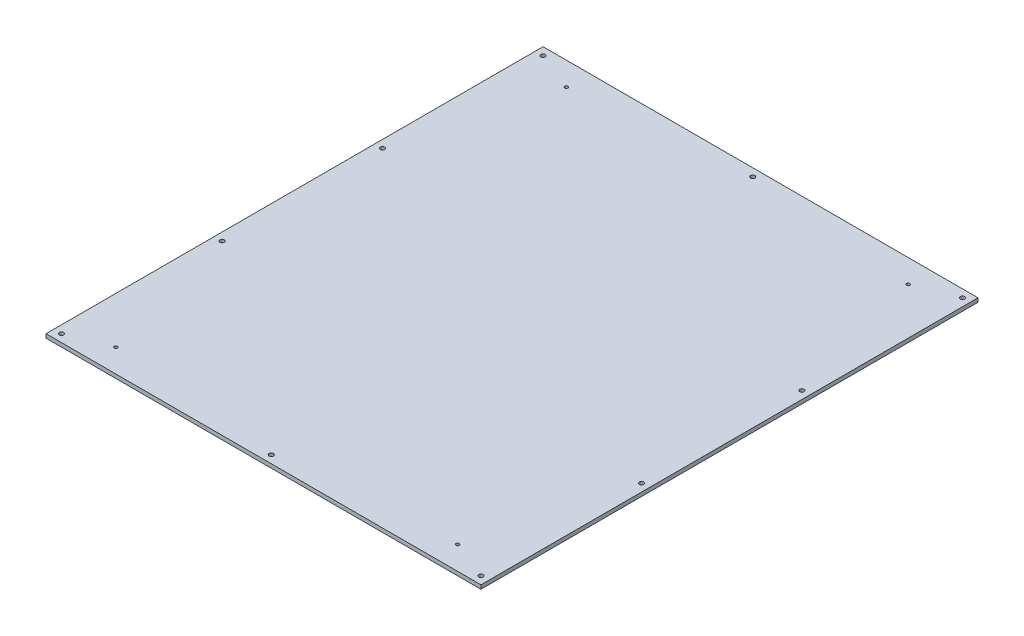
ISO-10303-21;
HEADER;
FILE_DESCRIPTION(('STEP AP214'),'2;1');
FILE_NAME('part.step','',(''),(''),'','','');
FILE_SCHEMA(('AUTOMOTIVE_DESIGN { 1 0 10303 214 1 1 1 1 }'));
ENDSEC;
DATA;
#1=APPLICATION_CONTEXT('core data for automotive mechanical design processes');
#2=APPLICATION_PROTOCOL_DEFINITION('international standard','automotive_design',2000,#1);
#3=PRODUCT_CONTEXT('',#1,'mechanical');
#4=PRODUCT('Part','Part','',(#3));
#5=PRODUCT_RELATED_PRODUCT_CATEGORY('part','',(#4));
#6=PRODUCT_DEFINITION_FORMATION('','',#4);
#7=PRODUCT_DEFINITION_CONTEXT('part definition',#1,'design');
#8=PRODUCT_DEFINITION('design','',#6,#7);
#9=PRODUCT_DEFINITION_SHAPE('','',#8);
#10=(LENGTH_UNIT() NAMED_UNIT(*) SI_UNIT(.MILLI.,.METRE.));
#11=(NAMED_UNIT(*) PLANE_ANGLE_UNIT() SI_UNIT($,.RADIAN.));
#12=(NAMED_UNIT(*) SI_UNIT($,.STERADIAN.) SOLID_ANGLE_UNIT());
#13=UNCERTAINTY_MEASURE_WITH_UNIT(LENGTH_MEASURE(1.E-05),#10,'distance_accuracy_value','');
#14=(GEOMETRIC_REPRESENTATION_CONTEXT(3) GLOBAL_UNCERTAINTY_ASSIGNED_CONTEXT((#13)) GLOBAL_UNIT_ASSIGNED_CONTEXT((#10,
#11,#12)) REPRESENTATION_CONTEXT('',''));
#15=CARTESIAN_POINT('',(0.,0.,0.));
#16=DIRECTION('',(0.,0.,1.));
#17=DIRECTION('',(1.,0.,0.));
#18=AXIS2_PLACEMENT_3D('',#15,#16,#17);
#19=CARTESIAN_POINT('',(355.6,6.35,-406.4));
#20=DIRECTION('',(-1.,0.,0.));
#21=DIRECTION('',(0.,0.,1.));
#22=AXIS2_PLACEMENT_3D('',#19,#20,#21);
#23=PLANE('',#22);
#24=DIRECTION('',(0.,0.,-1.));
#25=VECTOR('',#24,1.);
#26=CARTESIAN_POINT('',(355.6,0.,-406.4));
#27=LINE('',#26,#25);
#28=CARTESIAN_POINT('',(355.6,0.,406.4));
#29=VERTEX_POINT('',#28);
#30=CARTESIAN_POINT('',(355.6,0.,-406.4));
#31=VERTEX_POINT('',#30);
#32=EDGE_CURVE('E101',#29,#31,#27,.T.);
#33=ORIENTED_EDGE('',*,*,#32,.T.);
#34=DIRECTION('',(0.,-1.,0.));
#35=VECTOR('',#34,1.);
#36=CARTESIAN_POINT('',(355.6,6.35,-406.4));
#37=LINE('',#36,#35);
#38=CARTESIAN_POINT('',(355.6,6.35,-406.4));
#39=VERTEX_POINT('',#38);
#40=EDGE_CURVE('E11',#39,#31,#37,.T.);
#41=ORIENTED_EDGE('',*,*,#40,.F.);
#42=DIRECTION('',(0.,0.,-1.));
#43=VECTOR('',#42,1.);
#44=CARTESIAN_POINT('',(355.6,6.35,-406.4));
#45=LINE('',#44,#43);
#46=CARTESIAN_POINT('',(355.6,6.35,406.4));
#47=VERTEX_POINT('',#46);
#48=EDGE_CURVE('E88',#47,#39,#45,.T.);
#49=ORIENTED_EDGE('',*,*,#48,.F.);
#50=DIRECTION('',(0.,-1.,0.));
#51=VECTOR('',#50,1.);
#52=CARTESIAN_POINT('',(355.6,6.35,406.4));
#53=LINE('',#52,#51);
#54=EDGE_CURVE('E97',#47,#29,#53,.T.);
#55=ORIENTED_EDGE('',*,*,#54,.T.);
#56=EDGE_LOOP('',(#33,#41,#49,#55));
#57=FACE_BOUND('',#56,.T.);
#58=ADVANCED_FACE('F35',(#57),#23,.F.);
#59=CARTESIAN_POINT('',(-355.6,6.35,-406.4));
#60=DIRECTION('',(0.,0.,1.));
#61=DIRECTION('',(1.,0.,0.));
#62=AXIS2_PLACEMENT_3D('',#59,#60,#61);
#63=PLANE('',#62);
#64=DIRECTION('',(-1.,0.,0.));
#65=VECTOR('',#64,1.);
#66=CARTESIAN_POINT('',(-355.6,0.,-406.4));
#67=LINE('',#66,#65);
#68=CARTESIAN_POINT('',(-355.6,0.,-406.4));
#69=VERTEX_POINT('',#68);
#70=EDGE_CURVE('E92',#31,#69,#67,.T.);
#71=ORIENTED_EDGE('',*,*,#70,.T.);
#72=DIRECTION('',(0.,-1.,0.));
#73=VECTOR('',#72,1.);
#74=CARTESIAN_POINT('',(-355.6,6.35,-406.4));
#75=LINE('',#74,#73);
#76=CARTESIAN_POINT('',(-355.6,6.35,-406.4));
#77=VERTEX_POINT('',#76);
#78=EDGE_CURVE('E44',#77,#69,#75,.T.);
#79=ORIENTED_EDGE('',*,*,#78,.F.);
#80=DIRECTION('',(-1.,0.,0.));
#81=VECTOR('',#80,1.);
#82=CARTESIAN_POINT('',(-355.6,6.35,-406.4));
#83=LINE('',#82,#81);
#84=EDGE_CURVE('E83',#39,#77,#83,.T.);
#85=ORIENTED_EDGE('',*,*,#84,.F.);
#86=ORIENTED_EDGE('',*,*,#40,.T.);
#87=EDGE_LOOP('',(#71,#79,#85,#86));
#88=FACE_BOUND('',#87,.T.);
#89=ADVANCED_FACE('F91',(#88),#63,.F.);
#90=CARTESIAN_POINT('',(-355.6,6.35,-406.4));
#91=DIRECTION('',(1.,0.,0.));
#92=DIRECTION('',(0.,0.,-1.));
#93=AXIS2_PLACEMENT_3D('',#90,#91,#92);
#94=PLANE('',#93);
#95=DIRECTION('',(0.,0.,1.));
#96=VECTOR('',#95,1.);
#97=CARTESIAN_POINT('',(-355.6,0.,-406.4));
#98=LINE('',#97,#96);
#99=CARTESIAN_POINT('',(-355.6,0.,406.4));
#100=VERTEX_POINT('',#99);
#101=EDGE_CURVE('E70',#69,#100,#98,.T.);
#102=ORIENTED_EDGE('',*,*,#101,.T.);
#103=DIRECTION('',(0.,-1.,0.));
#104=VECTOR('',#103,1.);
#105=CARTESIAN_POINT('',(-355.6,6.35,406.4));
#106=LINE('',#105,#104);
#107=CARTESIAN_POINT('',(-355.6,6.35,406.4));
#108=VERTEX_POINT('',#107);
#109=EDGE_CURVE('E93',#108,#100,#106,.T.);
#110=ORIENTED_EDGE('',*,*,#109,.F.);
#111=DIRECTION('',(0.,0.,1.));
#112=VECTOR('',#111,1.);
#113=CARTESIAN_POINT('',(-355.6,6.35,-406.4));
#114=LINE('',#113,#112);
#115=EDGE_CURVE('E86',#77,#108,#114,.T.);
#116=ORIENTED_EDGE('',*,*,#115,.F.);
#117=ORIENTED_EDGE('',*,*,#78,.T.);
#118=EDGE_LOOP('',(#102,#110,#116,#117));
#119=FACE_BOUND('',#118,.T.);
#120=ADVANCED_FACE('F95',(#119),#94,.F.);
#121=CARTESIAN_POINT('',(-355.6,6.35,406.4));
#122=DIRECTION('',(0.,0.,-1.));
#123=DIRECTION('',(-1.,0.,0.));
#124=AXIS2_PLACEMENT_3D('',#121,#122,#123);
#125=PLANE('',#124);
#126=DIRECTION('',(1.,0.,0.));
#127=VECTOR('',#126,1.);
#128=CARTESIAN_POINT('',(-355.6,0.,406.4));
#129=LINE('',#128,#127);
#130=EDGE_CURVE('E76',#100,#29,#129,.T.);
#131=ORIENTED_EDGE('',*,*,#130,.T.);
#132=ORIENTED_EDGE('',*,*,#54,.F.);
#133=DIRECTION('',(1.,0.,0.));
#134=VECTOR('',#133,1.);
#135=CARTESIAN_POINT('',(-355.6,6.35,406.4));
#136=LINE('',#135,#134);
#137=EDGE_CURVE('E53',#108,#47,#136,.T.);
#138=ORIENTED_EDGE('',*,*,#137,.F.);
#139=ORIENTED_EDGE('',*,*,#109,.T.);
#140=EDGE_LOOP('',(#131,#132,#138,#139));
#141=FACE_BOUND('',#140,.T.);
#142=ADVANCED_FACE('F195',(#141),#125,.F.);
#143=CARTESIAN_POINT('',(0.,6.35,0.));
#144=DIRECTION('',(0.,1.,0.));
#145=DIRECTION('',(0.,0.,1.));
#146=AXIS2_PLACEMENT_3D('',#143,#144,#145);
#147=PLANE('',#146);
#148=CARTESIAN_POINT('',(-279.4,6.35,-368.3));
#149=DIRECTION('',(0.,1.,0.));
#150=DIRECTION('',(0.,0.,1.));
#151=AXIS2_PLACEMENT_3D('',#148,#149,#150);
#152=CIRCLE('',#151,2.70509999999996);
#153=CARTESIAN_POINT('',(-279.4,6.35,-365.5949));
#154=VERTEX_POINT('',#153);
#155=EDGE_CURVE('E376',#154,#154,#152,.T.);
#156=ORIENTED_EDGE('',*,*,#155,.F.);
#157=EDGE_LOOP('',(#156));
#158=FACE_BOUND('',#157,.T.);
#159=CARTESIAN_POINT('',(279.4,6.35,-368.3));
#160=DIRECTION('',(0.,1.,0.));
#161=DIRECTION('',(0.,0.,1.));
#162=AXIS2_PLACEMENT_3D('',#159,#160,#161);
#163=CIRCLE('',#162,2.70509999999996);
#164=CARTESIAN_POINT('',(279.4,6.35,-365.5949));
#165=VERTEX_POINT('',#164);
#166=EDGE_CURVE('E378',#165,#165,#163,.T.);
#167=ORIENTED_EDGE('',*,*,#166,.F.);
#168=EDGE_LOOP('',(#167));
#169=FACE_BOUND('',#168,.T.);
#170=CARTESIAN_POINT('',(279.4,6.35,368.3));
#171=DIRECTION('',(0.,1.,0.));
#172=DIRECTION('',(0.,0.,1.));
#173=AXIS2_PLACEMENT_3D('',#170,#171,#172);
#174=CIRCLE('',#173,2.70509999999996);
#175=CARTESIAN_POINT('',(279.4,6.35,371.0051));
#176=VERTEX_POINT('',#175);
#177=EDGE_CURVE('E386',#176,#176,#174,.T.);
#178=ORIENTED_EDGE('',*,*,#177,.F.);
#179=EDGE_LOOP('',(#178));
#180=FACE_BOUND('',#179,.T.);
#181=CARTESIAN_POINT('',(-279.4,6.35,368.3));
#182=DIRECTION('',(0.,1.,0.));
#183=DIRECTION('',(0.,0.,1.));
#184=AXIS2_PLACEMENT_3D('',#181,#182,#183);
#185=CIRCLE('',#184,2.70509999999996);
#186=CARTESIAN_POINT('',(-279.4,6.35,371.0051));
#187=VERTEX_POINT('',#186);
#188=EDGE_CURVE('E392',#187,#187,#185,.T.);
#189=ORIENTED_EDGE('',*,*,#188,.F.);
#190=EDGE_LOOP('',(#189));
#191=FACE_BOUND('',#190,.T.);
#192=CARTESIAN_POINT('',(-342.9,6.35,-393.7));
#193=DIRECTION('',(0.,1.,0.));
#194=DIRECTION('',(0.,0.,1.));
#195=AXIS2_PLACEMENT_3D('',#192,#193,#194);
#196=CIRCLE('',#195,3.57123999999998);
#197=CARTESIAN_POINT('',(-342.9,6.35,-390.12876));
#198=VERTEX_POINT('',#197);
#199=EDGE_CURVE('E150',#198,#198,#196,.T.);
#200=ORIENTED_EDGE('',*,*,#199,.F.);
#201=EDGE_LOOP('',(#200));
#202=FACE_BOUND('',#201,.T.);
#203=CARTESIAN_POINT('',(0.,6.35,-393.7));
#204=DIRECTION('',(0.,1.,0.));
#205=DIRECTION('',(0.,0.,1.));
#206=AXIS2_PLACEMENT_3D('',#203,#204,#205);
#207=CIRCLE('',#206,3.57123999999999);
#208=CARTESIAN_POINT('',(0.,6.35,-390.12876));
#209=VERTEX_POINT('',#208);
#210=EDGE_CURVE('E140',#209,#209,#207,.T.);
#211=ORIENTED_EDGE('',*,*,#210,.F.);
#212=EDGE_LOOP('',(#211));
#213=FACE_BOUND('',#212,.T.);
#214=CARTESIAN_POINT('',(342.9,6.35,-393.7));
#215=DIRECTION('',(0.,1.,0.));
#216=DIRECTION('',(0.,0.,1.));
#217=AXIS2_PLACEMENT_3D('',#214,#215,#216);
#218=CIRCLE('',#217,3.57123999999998);
#219=CARTESIAN_POINT('',(342.9,6.35,-390.12876));
#220=VERTEX_POINT('',#219);
#221=EDGE_CURVE('E137',#220,#220,#218,.T.);
#222=ORIENTED_EDGE('',*,*,#221,.F.);
#223=EDGE_LOOP('',(#222));
#224=FACE_BOUND('',#223,.T.);
#225=CARTESIAN_POINT('',(342.9,6.35,-131.233333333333));
#226=DIRECTION('',(0.,1.,0.));
#227=DIRECTION('',(0.,0.,1.));
#228=AXIS2_PLACEMENT_3D('',#225,#226,#227);
#229=CIRCLE('',#228,3.57123999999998);
#230=CARTESIAN_POINT('',(342.9,6.35,-127.662093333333));
#231=VERTEX_POINT('',#230);
#232=EDGE_CURVE('E134',#231,#231,#229,.T.);
#233=ORIENTED_EDGE('',*,*,#232,.F.);
#234=EDGE_LOOP('',(#233));
#235=FACE_BOUND('',#234,.T.);
#236=CARTESIAN_POINT('',(342.9,6.35,131.233333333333));
#237=DIRECTION('',(0.,1.,0.));
#238=DIRECTION('',(0.,0.,1.));
#239=AXIS2_PLACEMENT_3D('',#236,#237,#238);
#240=CIRCLE('',#239,3.57123999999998);
#241=CARTESIAN_POINT('',(342.9,6.35,134.804573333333));
#242=VERTEX_POINT('',#241);
#243=EDGE_CURVE('E130',#242,#242,#240,.T.);
#244=ORIENTED_EDGE('',*,*,#243,.F.);
#245=EDGE_LOOP('',(#244));
#246=FACE_BOUND('',#245,.T.);
#247=CARTESIAN_POINT('',(342.9,6.35,393.7));
#248=DIRECTION('',(0.,1.,0.));
#249=DIRECTION('',(0.,0.,1.));
#250=AXIS2_PLACEMENT_3D('',#247,#248,#249);
#251=CIRCLE('',#250,3.57123999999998);
#252=CARTESIAN_POINT('',(342.9,6.35,397.27124));
#253=VERTEX_POINT('',#252);
#254=EDGE_CURVE('E126',#253,#253,#251,.T.);
#255=ORIENTED_EDGE('',*,*,#254,.F.);
#256=EDGE_LOOP('',(#255));
#257=FACE_BOUND('',#256,.T.);
#258=CARTESIAN_POINT('',(0.,6.35,393.7));
#259=DIRECTION('',(0.,1.,0.));
#260=DIRECTION('',(0.,0.,1.));
#261=AXIS2_PLACEMENT_3D('',#258,#259,#260);
#262=CIRCLE('',#261,3.57123999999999);
#263=CARTESIAN_POINT('',(0.,6.35,397.27124));
#264=VERTEX_POINT('',#263);
#265=EDGE_CURVE('E122',#264,#264,#262,.T.);
#266=ORIENTED_EDGE('',*,*,#265,.F.);
#267=EDGE_LOOP('',(#266));
#268=FACE_BOUND('',#267,.T.);
#269=CARTESIAN_POINT('',(-342.9,6.35,393.7));
#270=DIRECTION('',(0.,1.,0.));
#271=DIRECTION('',(0.,0.,1.));
#272=AXIS2_PLACEMENT_3D('',#269,#270,#271);
#273=CIRCLE('',#272,3.57123999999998);
#274=CARTESIAN_POINT('',(-342.9,6.35,397.27124));
#275=VERTEX_POINT('',#274);
#276=EDGE_CURVE('E118',#275,#275,#273,.T.);
#277=ORIENTED_EDGE('',*,*,#276,.F.);
#278=EDGE_LOOP('',(#277));
#279=FACE_BOUND('',#278,.T.);
#280=CARTESIAN_POINT('',(-342.9,6.35,131.233333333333));
#281=DIRECTION('',(0.,1.,0.));
#282=DIRECTION('',(0.,0.,1.));
#283=AXIS2_PLACEMENT_3D('',#280,#281,#282);
#284=CIRCLE('',#283,3.57123999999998);
#285=CARTESIAN_POINT('',(-342.9,6.35,134.804573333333));
#286=VERTEX_POINT('',#285);
#287=EDGE_CURVE('E114',#286,#286,#284,.T.);
#288=ORIENTED_EDGE('',*,*,#287,.F.);
#289=EDGE_LOOP('',(#288));
#290=FACE_BOUND('',#289,.T.);
#291=CARTESIAN_POINT('',(-342.9,6.35,-131.233333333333));
#292=DIRECTION('',(0.,1.,0.));
#293=DIRECTION('',(0.,0.,1.));
#294=AXIS2_PLACEMENT_3D('',#291,#292,#293);
#295=CIRCLE('',#294,3.57123999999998);
#296=CARTESIAN_POINT('',(-342.9,6.35,-127.662093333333));
#297=VERTEX_POINT('',#296);
#298=EDGE_CURVE('E113',#297,#297,#295,.T.);
#299=ORIENTED_EDGE('',*,*,#298,.F.);
#300=EDGE_LOOP('',(#299));
#301=FACE_BOUND('',#300,.T.);
#302=ORIENTED_EDGE('',*,*,#48,.T.);
#303=ORIENTED_EDGE('',*,*,#84,.T.);
#304=ORIENTED_EDGE('',*,*,#115,.T.);
#305=ORIENTED_EDGE('',*,*,#137,.T.);
#306=EDGE_LOOP('',(#302,#303,#304,#305));
#307=FACE_BOUND('',#306,.T.);
#308=ADVANCED_FACE('F84',(#158,#169,#180,#191,#202,#213,#224,#235,#246,#257,#268,#279,#290,#301,
#307),#147,.T.);
#309=CARTESIAN_POINT('',(0.,0.,0.));
#310=DIRECTION('',(0.,1.,0.));
#311=DIRECTION('',(0.,0.,1.));
#312=AXIS2_PLACEMENT_3D('',#309,#310,#311);
#313=PLANE('',#312);
#314=CARTESIAN_POINT('',(-279.4,0.,-368.3));
#315=DIRECTION('',(0.,1.,0.));
#316=DIRECTION('',(0.,0.,1.));
#317=AXIS2_PLACEMENT_3D('',#314,#315,#316);
#318=CIRCLE('',#317,2.70510000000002);
#319=CARTESIAN_POINT('',(-279.4,0.,-365.5949));
#320=VERTEX_POINT('',#319);
#321=EDGE_CURVE('E373',#320,#320,#318,.T.);
#322=ORIENTED_EDGE('',*,*,#321,.T.);
#323=EDGE_LOOP('',(#322));
#324=FACE_BOUND('',#323,.T.);
#325=CARTESIAN_POINT('',(279.4,0.,-368.3));
#326=DIRECTION('',(0.,1.,0.));
#327=DIRECTION('',(0.,0.,1.));
#328=AXIS2_PLACEMENT_3D('',#325,#326,#327);
#329=CIRCLE('',#328,2.70510000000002);
#330=CARTESIAN_POINT('',(279.4,0.,-365.5949));
#331=VERTEX_POINT('',#330);
#332=EDGE_CURVE('E383',#331,#331,#329,.T.);
#333=ORIENTED_EDGE('',*,*,#332,.T.);
#334=EDGE_LOOP('',(#333));
#335=FACE_BOUND('',#334,.T.);
#336=CARTESIAN_POINT('',(279.4,0.,368.3));
#337=DIRECTION('',(0.,1.,0.));
#338=DIRECTION('',(0.,0.,1.));
#339=AXIS2_PLACEMENT_3D('',#336,#337,#338);
#340=CIRCLE('',#339,2.70510000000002);
#341=CARTESIAN_POINT('',(279.4,0.,371.0051));
#342=VERTEX_POINT('',#341);
#343=EDGE_CURVE('E389',#342,#342,#340,.T.);
#344=ORIENTED_EDGE('',*,*,#343,.T.);
#345=EDGE_LOOP('',(#344));
#346=FACE_BOUND('',#345,.T.);
#347=CARTESIAN_POINT('',(-279.4,0.,368.3));
#348=DIRECTION('',(0.,1.,0.));
#349=DIRECTION('',(0.,0.,1.));
#350=AXIS2_PLACEMENT_3D('',#347,#348,#349);
#351=CIRCLE('',#350,2.70510000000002);
#352=CARTESIAN_POINT('',(-279.4,0.,371.0051));
#353=VERTEX_POINT('',#352);
#354=EDGE_CURVE('E394',#353,#353,#351,.T.);
#355=ORIENTED_EDGE('',*,*,#354,.T.);
#356=EDGE_LOOP('',(#355));
#357=FACE_BOUND('',#356,.T.);
#358=CARTESIAN_POINT('',(-342.9,0.,-393.7));
#359=DIRECTION('',(0.,1.,0.));
#360=DIRECTION('',(0.,0.,1.));
#361=AXIS2_PLACEMENT_3D('',#358,#359,#360);
#362=CIRCLE('',#361,3.57123999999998);
#363=CARTESIAN_POINT('',(-342.9,0.,-390.12876));
#364=VERTEX_POINT('',#363);
#365=EDGE_CURVE('E38',#364,#364,#362,.T.);
#366=ORIENTED_EDGE('',*,*,#365,.T.);
#367=EDGE_LOOP('',(#366));
#368=FACE_BOUND('',#367,.T.);
#369=CARTESIAN_POINT('',(0.,0.,-393.7));
#370=DIRECTION('',(0.,1.,0.));
#371=DIRECTION('',(0.,0.,1.));
#372=AXIS2_PLACEMENT_3D('',#369,#370,#371);
#373=CIRCLE('',#372,3.57123999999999);
#374=CARTESIAN_POINT('',(0.,0.,-390.12876));
#375=VERTEX_POINT('',#374);
#376=EDGE_CURVE('E138',#375,#375,#373,.T.);
#377=ORIENTED_EDGE('',*,*,#376,.T.);
#378=EDGE_LOOP('',(#377));
#379=FACE_BOUND('',#378,.T.);
#380=CARTESIAN_POINT('',(342.9,0.,-393.7));
#381=DIRECTION('',(0.,1.,0.));
#382=DIRECTION('',(0.,0.,1.));
#383=AXIS2_PLACEMENT_3D('',#380,#381,#382);
#384=CIRCLE('',#383,3.57123999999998);
#385=CARTESIAN_POINT('',(342.9,0.,-390.12876));
#386=VERTEX_POINT('',#385);
#387=EDGE_CURVE('E135',#386,#386,#384,.T.);
#388=ORIENTED_EDGE('',*,*,#387,.T.);
#389=EDGE_LOOP('',(#388));
#390=FACE_BOUND('',#389,.T.);
#391=CARTESIAN_POINT('',(342.9,0.,-131.233333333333));
#392=DIRECTION('',(0.,1.,0.));
#393=DIRECTION('',(0.,0.,1.));
#394=AXIS2_PLACEMENT_3D('',#391,#392,#393);
#395=CIRCLE('',#394,3.57123999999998);
#396=CARTESIAN_POINT('',(342.9,0.,-127.662093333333));
#397=VERTEX_POINT('',#396);
#398=EDGE_CURVE('E131',#397,#397,#395,.T.);
#399=ORIENTED_EDGE('',*,*,#398,.T.);
#400=EDGE_LOOP('',(#399));
#401=FACE_BOUND('',#400,.T.);
#402=CARTESIAN_POINT('',(342.9,0.,131.233333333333));
#403=DIRECTION('',(0.,1.,0.));
#404=DIRECTION('',(0.,0.,1.));
#405=AXIS2_PLACEMENT_3D('',#402,#403,#404);
#406=CIRCLE('',#405,3.57123999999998);
#407=CARTESIAN_POINT('',(342.9,0.,134.804573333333));
#408=VERTEX_POINT('',#407);
#409=EDGE_CURVE('E127',#408,#408,#406,.T.);
#410=ORIENTED_EDGE('',*,*,#409,.T.);
#411=EDGE_LOOP('',(#410));
#412=FACE_BOUND('',#411,.T.);
#413=CARTESIAN_POINT('',(342.9,0.,393.7));
#414=DIRECTION('',(0.,1.,0.));
#415=DIRECTION('',(0.,0.,1.));
#416=AXIS2_PLACEMENT_3D('',#413,#414,#415);
#417=CIRCLE('',#416,3.57123999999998);
#418=CARTESIAN_POINT('',(342.9,0.,397.27124));
#419=VERTEX_POINT('',#418);
#420=EDGE_CURVE('E123',#419,#419,#417,.T.);
#421=ORIENTED_EDGE('',*,*,#420,.T.);
#422=EDGE_LOOP('',(#421));
#423=FACE_BOUND('',#422,.T.);
#424=CARTESIAN_POINT('',(0.,0.,393.7));
#425=DIRECTION('',(0.,1.,0.));
#426=DIRECTION('',(0.,0.,1.));
#427=AXIS2_PLACEMENT_3D('',#424,#425,#426);
#428=CIRCLE('',#427,3.57123999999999);
#429=CARTESIAN_POINT('',(0.,0.,397.27124));
#430=VERTEX_POINT('',#429);
#431=EDGE_CURVE('E119',#430,#430,#428,.T.);
#432=ORIENTED_EDGE('',*,*,#431,.T.);
#433=EDGE_LOOP('',(#432));
#434=FACE_BOUND('',#433,.T.);
#435=CARTESIAN_POINT('',(-342.9,0.,393.7));
#436=DIRECTION('',(0.,1.,0.));
#437=DIRECTION('',(0.,0.,1.));
#438=AXIS2_PLACEMENT_3D('',#435,#436,#437);
#439=CIRCLE('',#438,3.57123999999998);
#440=CARTESIAN_POINT('',(-342.9,0.,397.27124));
#441=VERTEX_POINT('',#440);
#442=EDGE_CURVE('E115',#441,#441,#439,.T.);
#443=ORIENTED_EDGE('',*,*,#442,.T.);
#444=EDGE_LOOP('',(#443));
#445=FACE_BOUND('',#444,.T.);
#446=CARTESIAN_POINT('',(-342.9,0.,131.233333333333));
#447=DIRECTION('',(0.,1.,0.));
#448=DIRECTION('',(0.,0.,1.));
#449=AXIS2_PLACEMENT_3D('',#446,#447,#448);
#450=CIRCLE('',#449,3.57123999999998);
#451=CARTESIAN_POINT('',(-342.9,0.,134.804573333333));
#452=VERTEX_POINT('',#451);
#453=EDGE_CURVE('E110',#452,#452,#450,.T.);
#454=ORIENTED_EDGE('',*,*,#453,.T.);
#455=EDGE_LOOP('',(#454));
#456=FACE_BOUND('',#455,.T.);
#457=CARTESIAN_POINT('',(-342.9,0.,-131.233333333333));
#458=DIRECTION('',(0.,1.,0.));
#459=DIRECTION('',(0.,0.,1.));
#460=AXIS2_PLACEMENT_3D('',#457,#458,#459);
#461=CIRCLE('',#460,3.57123999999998);
#462=CARTESIAN_POINT('',(-342.9,0.,-127.662093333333));
#463=VERTEX_POINT('',#462);
#464=EDGE_CURVE('E104',#463,#463,#461,.T.);
#465=ORIENTED_EDGE('',*,*,#464,.T.);
#466=EDGE_LOOP('',(#465));
#467=FACE_BOUND('',#466,.T.);
#468=ORIENTED_EDGE('',*,*,#32,.F.);
#469=ORIENTED_EDGE('',*,*,#130,.F.);
#470=ORIENTED_EDGE('',*,*,#101,.F.);
#471=ORIENTED_EDGE('',*,*,#70,.F.);
#472=EDGE_LOOP('',(#468,#469,#470,#471));
#473=FACE_BOUND('',#472,.T.);
#474=ADVANCED_FACE('F171',(#324,#335,#346,#357,#368,#379,#390,#401,#412,#423,#434,#445,#456,
#467,#473),#313,.F.);
#475=CARTESIAN_POINT('',(-342.9,6.35,-131.233333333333));
#476=DIRECTION('',(0.,1.,0.));
#477=DIRECTION('',(0.,0.,1.));
#478=AXIS2_PLACEMENT_3D('',#475,#476,#477);
#479=CYLINDRICAL_SURFACE('',#478,3.57123999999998);
#480=ORIENTED_EDGE('',*,*,#298,.T.);
#481=EDGE_LOOP('',(#480));
#482=FACE_BOUND('',#481,.T.);
#483=ORIENTED_EDGE('',*,*,#464,.F.);
#484=EDGE_LOOP('',(#483));
#485=FACE_BOUND('',#484,.T.);
#486=ADVANCED_FACE('F174',(#482,#485),#479,.F.);
#487=CARTESIAN_POINT('',(-342.9,6.35,131.233333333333));
#488=DIRECTION('',(0.,1.,0.));
#489=DIRECTION('',(0.,0.,1.));
#490=AXIS2_PLACEMENT_3D('',#487,#488,#489);
#491=CYLINDRICAL_SURFACE('',#490,3.57123999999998);
#492=ORIENTED_EDGE('',*,*,#287,.T.);
#493=EDGE_LOOP('',(#492));
#494=FACE_BOUND('',#493,.T.);
#495=ORIENTED_EDGE('',*,*,#453,.F.);
#496=EDGE_LOOP('',(#495));
#497=FACE_BOUND('',#496,.T.);
#498=ADVANCED_FACE('F176',(#494,#497),#491,.F.);
#499=CARTESIAN_POINT('',(-342.9,6.35,393.7));
#500=DIRECTION('',(0.,1.,0.));
#501=DIRECTION('',(0.,0.,1.));
#502=AXIS2_PLACEMENT_3D('',#499,#500,#501);
#503=CYLINDRICAL_SURFACE('',#502,3.57123999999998);
#504=ORIENTED_EDGE('',*,*,#276,.T.);
#505=EDGE_LOOP('',(#504));
#506=FACE_BOUND('',#505,.T.);
#507=ORIENTED_EDGE('',*,*,#442,.F.);
#508=EDGE_LOOP('',(#507));
#509=FACE_BOUND('',#508,.T.);
#510=ADVANCED_FACE('F183',(#506,#509),#503,.F.);
#511=CARTESIAN_POINT('',(0.,6.35,393.7));
#512=DIRECTION('',(0.,1.,0.));
#513=DIRECTION('',(0.,0.,1.));
#514=AXIS2_PLACEMENT_3D('',#511,#512,#513);
#515=CYLINDRICAL_SURFACE('',#514,3.57123999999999);
#516=ORIENTED_EDGE('',*,*,#265,.T.);
#517=EDGE_LOOP('',(#516));
#518=FACE_BOUND('',#517,.T.);
#519=ORIENTED_EDGE('',*,*,#431,.F.);
#520=EDGE_LOOP('',(#519));
#521=FACE_BOUND('',#520,.T.);
#522=ADVANCED_FACE('F251',(#518,#521),#515,.F.);
#523=CARTESIAN_POINT('',(342.9,6.35,393.7));
#524=DIRECTION('',(0.,1.,0.));
#525=DIRECTION('',(0.,0.,1.));
#526=AXIS2_PLACEMENT_3D('',#523,#524,#525);
#527=CYLINDRICAL_SURFACE('',#526,3.57123999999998);
#528=ORIENTED_EDGE('',*,*,#254,.T.);
#529=EDGE_LOOP('',(#528));
#530=FACE_BOUND('',#529,.T.);
#531=ORIENTED_EDGE('',*,*,#420,.F.);
#532=EDGE_LOOP('',(#531));
#533=FACE_BOUND('',#532,.T.);
#534=ADVANCED_FACE('F260',(#530,#533),#527,.F.);
#535=CARTESIAN_POINT('',(342.9,6.35,131.233333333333));
#536=DIRECTION('',(0.,1.,0.));
#537=DIRECTION('',(0.,0.,1.));
#538=AXIS2_PLACEMENT_3D('',#535,#536,#537);
#539=CYLINDRICAL_SURFACE('',#538,3.57123999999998);
#540=ORIENTED_EDGE('',*,*,#243,.T.);
#541=EDGE_LOOP('',(#540));
#542=FACE_BOUND('',#541,.T.);
#543=ORIENTED_EDGE('',*,*,#409,.F.);
#544=EDGE_LOOP('',(#543));
#545=FACE_BOUND('',#544,.T.);
#546=ADVANCED_FACE('F269',(#542,#545),#539,.F.);
#547=CARTESIAN_POINT('',(342.9,6.35,-131.233333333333));
#548=DIRECTION('',(0.,1.,0.));
#549=DIRECTION('',(0.,0.,1.));
#550=AXIS2_PLACEMENT_3D('',#547,#548,#549);
#551=CYLINDRICAL_SURFACE('',#550,3.57123999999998);
#552=ORIENTED_EDGE('',*,*,#232,.T.);
#553=EDGE_LOOP('',(#552));
#554=FACE_BOUND('',#553,.T.);
#555=ORIENTED_EDGE('',*,*,#398,.F.);
#556=EDGE_LOOP('',(#555));
#557=FACE_BOUND('',#556,.T.);
#558=ADVANCED_FACE('F278',(#554,#557),#551,.F.);
#559=CARTESIAN_POINT('',(342.9,6.35,-393.7));
#560=DIRECTION('',(0.,1.,0.));
#561=DIRECTION('',(0.,0.,1.));
#562=AXIS2_PLACEMENT_3D('',#559,#560,#561);
#563=CYLINDRICAL_SURFACE('',#562,3.57123999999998);
#564=ORIENTED_EDGE('',*,*,#221,.T.);
#565=EDGE_LOOP('',(#564));
#566=FACE_BOUND('',#565,.T.);
#567=ORIENTED_EDGE('',*,*,#387,.F.);
#568=EDGE_LOOP('',(#567));
#569=FACE_BOUND('',#568,.T.);
#570=ADVANCED_FACE('F287',(#566,#569),#563,.F.);
#571=CARTESIAN_POINT('',(0.,6.35,-393.7));
#572=DIRECTION('',(0.,1.,0.));
#573=DIRECTION('',(0.,0.,1.));
#574=AXIS2_PLACEMENT_3D('',#571,#572,#573);
#575=CYLINDRICAL_SURFACE('',#574,3.57123999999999);
#576=ORIENTED_EDGE('',*,*,#210,.T.);
#577=EDGE_LOOP('',(#576));
#578=FACE_BOUND('',#577,.T.);
#579=ORIENTED_EDGE('',*,*,#376,.F.);
#580=EDGE_LOOP('',(#579));
#581=FACE_BOUND('',#580,.T.);
#582=ADVANCED_FACE('F296',(#578,#581),#575,.F.);
#583=CARTESIAN_POINT('',(-342.9,6.35,-393.7));
#584=DIRECTION('',(0.,1.,0.));
#585=DIRECTION('',(0.,0.,1.));
#586=AXIS2_PLACEMENT_3D('',#583,#584,#585);
#587=CYLINDRICAL_SURFACE('',#586,3.57123999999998);
#588=ORIENTED_EDGE('',*,*,#199,.T.);
#589=EDGE_LOOP('',(#588));
#590=FACE_BOUND('',#589,.T.);
#591=ORIENTED_EDGE('',*,*,#365,.F.);
#592=EDGE_LOOP('',(#591));
#593=FACE_BOUND('',#592,.T.);
#594=ADVANCED_FACE('F305',(#590,#593),#587,.F.);
#595=CARTESIAN_POINT('',(-279.4,6.35,368.3));
#596=DIRECTION('',(0.,1.,0.));
#597=DIRECTION('',(0.,0.,1.));
#598=AXIS2_PLACEMENT_3D('',#595,#596,#597);
#599=CYLINDRICAL_SURFACE('',#598,2.70509999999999);
#600=ORIENTED_EDGE('',*,*,#354,.F.);
#601=EDGE_LOOP('',(#600));
#602=FACE_BOUND('',#601,.T.);
#603=ORIENTED_EDGE('',*,*,#188,.T.);
#604=EDGE_LOOP('',(#603));
#605=FACE_BOUND('',#604,.T.);
#606=ADVANCED_FACE('F312',(#602,#605),#599,.F.);
#607=CARTESIAN_POINT('',(279.4,6.35,368.3));
#608=DIRECTION('',(0.,1.,0.));
#609=DIRECTION('',(0.,0.,1.));
#610=AXIS2_PLACEMENT_3D('',#607,#608,#609);
#611=CYLINDRICAL_SURFACE('',#610,2.70509999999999);
#612=ORIENTED_EDGE('',*,*,#343,.F.);
#613=EDGE_LOOP('',(#612));
#614=FACE_BOUND('',#613,.T.);
#615=ORIENTED_EDGE('',*,*,#177,.T.);
#616=EDGE_LOOP('',(#615));
#617=FACE_BOUND('',#616,.T.);
#618=ADVANCED_FACE('F320',(#614,#617),#611,.F.);
#619=CARTESIAN_POINT('',(279.4,6.35,-368.3));
#620=DIRECTION('',(0.,1.,0.));
#621=DIRECTION('',(0.,0.,1.));
#622=AXIS2_PLACEMENT_3D('',#619,#620,#621);
#623=CYLINDRICAL_SURFACE('',#622,2.70509999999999);
#624=ORIENTED_EDGE('',*,*,#332,.F.);
#625=EDGE_LOOP('',(#624));
#626=FACE_BOUND('',#625,.T.);
#627=ORIENTED_EDGE('',*,*,#166,.T.);
#628=EDGE_LOOP('',(#627));
#629=FACE_BOUND('',#628,.T.);
#630=ADVANCED_FACE('F330',(#626,#629),#623,.F.);
#631=CARTESIAN_POINT('',(-279.4,6.35,-368.3));
#632=DIRECTION('',(0.,1.,0.));
#633=DIRECTION('',(0.,0.,1.));
#634=AXIS2_PLACEMENT_3D('',#631,#632,#633);
#635=CYLINDRICAL_SURFACE('',#634,2.70509999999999);
#636=ORIENTED_EDGE('',*,*,#321,.F.);
#637=EDGE_LOOP('',(#636));
#638=FACE_BOUND('',#637,.T.);
#639=ORIENTED_EDGE('',*,*,#155,.T.);
#640=EDGE_LOOP('',(#639));
#641=FACE_BOUND('',#640,.T.);
#642=ADVANCED_FACE('F340',(#638,#641),#635,.F.);
#643=CLOSED_SHELL('',(#58,#89,#120,#142,#308,#474,#486,#498,#510,#522,#534,#546,#558,#570,#582,
#594,#606,#618,#630,#642));
#644=MANIFOLD_SOLID_BREP('B2',#643);
#645=ADVANCED_BREP_SHAPE_REPRESENTATION('',(#18,#644),#14);
#646=SHAPE_DEFINITION_REPRESENTATION(#9,#645);
ENDSEC;
END-ISO-10303-21;
